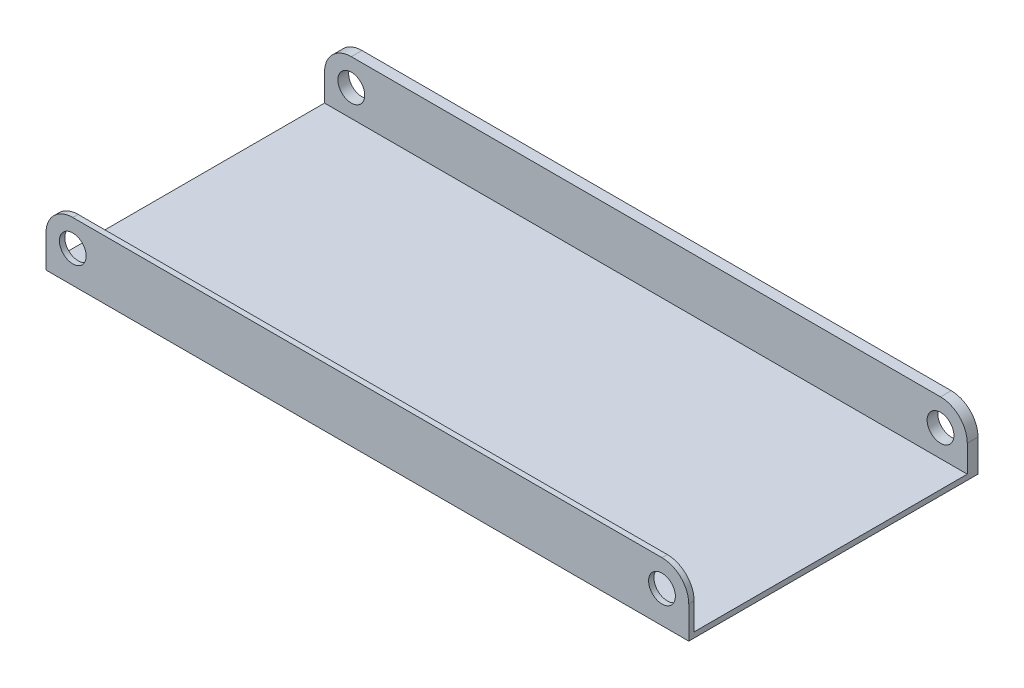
ISO-10303-21;
HEADER;
FILE_DESCRIPTION(('STEP AP214'),'2;1');
FILE_NAME('part.step','',(''),(''),'','','');
FILE_SCHEMA(('AUTOMOTIVE_DESIGN { 1 0 10303 214 1 1 1 1 }'));
ENDSEC;
DATA;
#1=APPLICATION_CONTEXT('core data for automotive mechanical design processes');
#2=APPLICATION_PROTOCOL_DEFINITION('international standard','automotive_design',2000,#1);
#3=PRODUCT_CONTEXT('',#1,'mechanical');
#4=PRODUCT('Part','Part','',(#3));
#5=PRODUCT_RELATED_PRODUCT_CATEGORY('part','',(#4));
#6=PRODUCT_DEFINITION_FORMATION('','',#4);
#7=PRODUCT_DEFINITION_CONTEXT('part definition',#1,'design');
#8=PRODUCT_DEFINITION('design','',#6,#7);
#9=PRODUCT_DEFINITION_SHAPE('','',#8);
#10=(LENGTH_UNIT() NAMED_UNIT(*) SI_UNIT(.MILLI.,.METRE.));
#11=(NAMED_UNIT(*) PLANE_ANGLE_UNIT() SI_UNIT($,.RADIAN.));
#12=(NAMED_UNIT(*) SI_UNIT($,.STERADIAN.) SOLID_ANGLE_UNIT());
#13=UNCERTAINTY_MEASURE_WITH_UNIT(LENGTH_MEASURE(1.E-05),#10,'distance_accuracy_value','');
#14=(GEOMETRIC_REPRESENTATION_CONTEXT(3) GLOBAL_UNCERTAINTY_ASSIGNED_CONTEXT((#13)) GLOBAL_UNIT_ASSIGNED_CONTEXT((#10,
#11,#12)) REPRESENTATION_CONTEXT('',''));
#15=CARTESIAN_POINT('',(0.,0.,0.));
#16=DIRECTION('',(0.,0.,1.));
#17=DIRECTION('',(1.,0.,0.));
#18=AXIS2_PLACEMENT_3D('',#15,#16,#17);
#19=CARTESIAN_POINT('',(0.,1.27,0.));
#20=DIRECTION('',(0.,1.,0.));
#21=DIRECTION('',(0.,0.,1.));
#22=AXIS2_PLACEMENT_3D('',#19,#20,#21);
#23=PLANE('',#22);
#24=DIRECTION('',(0.,0.,-1.));
#25=VECTOR('',#24,1.);
#26=CARTESIAN_POINT('',(152.4,1.27,0.));
#27=LINE('',#26,#25);
#28=CARTESIAN_POINT('',(152.4,1.27,67.31));
#29=VERTEX_POINT('',#28);
#30=CARTESIAN_POINT('',(152.4,1.27,2.53999999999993));
#31=VERTEX_POINT('',#30);
#32=EDGE_CURVE('E140',#29,#31,#27,.T.);
#33=ORIENTED_EDGE('',*,*,#32,.T.);
#34=DIRECTION('',(1.,0.,0.));
#35=VECTOR('',#34,1.);
#36=CARTESIAN_POINT('',(0.,1.27,2.53999999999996));
#37=LINE('',#36,#35);
#38=CARTESIAN_POINT('',(0.,1.27,2.53999999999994));
#39=VERTEX_POINT('',#38);
#40=EDGE_CURVE('E139',#39,#31,#37,.T.);
#41=ORIENTED_EDGE('',*,*,#40,.F.);
#42=DIRECTION('',(0.,0.,1.));
#43=VECTOR('',#42,1.);
#44=CARTESIAN_POINT('',(0.,1.27,0.));
#45=LINE('',#44,#43);
#46=CARTESIAN_POINT('',(0.,1.27,67.31));
#47=VERTEX_POINT('',#46);
#48=EDGE_CURVE('E123',#39,#47,#45,.T.);
#49=ORIENTED_EDGE('',*,*,#48,.T.);
#50=DIRECTION('',(-1.,0.,0.));
#51=VECTOR('',#50,1.);
#52=CARTESIAN_POINT('',(0.,1.27,67.31));
#53=LINE('',#52,#51);
#54=EDGE_CURVE('E136',#29,#47,#53,.T.);
#55=ORIENTED_EDGE('',*,*,#54,.F.);
#56=EDGE_LOOP('',(#33,#41,#49,#55));
#57=FACE_BOUND('',#56,.T.);
#58=ADVANCED_FACE('F34',(#57),#23,.T.);
#59=CARTESIAN_POINT('',(0.,1.27,0.));
#60=DIRECTION('',(1.,0.,0.));
#61=DIRECTION('',(0.,0.,-1.));
#62=AXIS2_PLACEMENT_3D('',#59,#60,#61);
#63=PLANE('',#62);
#64=DIRECTION('',(0.,-1.,0.));
#65=VECTOR('',#64,1.);
#66=CARTESIAN_POINT('',(0.,13.97,2.53999999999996));
#67=LINE('',#66,#65);
#68=CARTESIAN_POINT('',(0.,7.62,2.53999999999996));
#69=VERTEX_POINT('',#68);
#70=EDGE_CURVE('E147',#69,#39,#67,.T.);
#71=ORIENTED_EDGE('',*,*,#70,.F.);
#72=DIRECTION('',(0.,0.,1.));
#73=VECTOR('',#72,1.);
#74=CARTESIAN_POINT('',(0.,7.62,0.));
#75=LINE('',#74,#73);
#76=CARTESIAN_POINT('',(0.,7.62,0.));
#77=VERTEX_POINT('',#76);
#78=EDGE_CURVE('E11',#69,#77,#75,.F.);
#79=ORIENTED_EDGE('',*,*,#78,.T.);
#80=DIRECTION('',(0.,-1.,0.));
#81=VECTOR('',#80,1.);
#82=CARTESIAN_POINT('',(0.,1.27,0.));
#83=LINE('',#82,#81);
#84=CARTESIAN_POINT('',(0.,0.,0.));
#85=VERTEX_POINT('',#84);
#86=EDGE_CURVE('E158',#77,#85,#83,.T.);
#87=ORIENTED_EDGE('',*,*,#86,.T.);
#88=DIRECTION('',(0.,0.,1.));
#89=VECTOR('',#88,1.);
#90=CARTESIAN_POINT('',(0.,0.,0.));
#91=LINE('',#90,#89);
#92=CARTESIAN_POINT('',(0.,0.,68.58));
#93=VERTEX_POINT('',#92);
#94=EDGE_CURVE('E155',#85,#93,#91,.T.);
#95=ORIENTED_EDGE('',*,*,#94,.T.);
#96=DIRECTION('',(0.,-1.,0.));
#97=VECTOR('',#96,1.);
#98=CARTESIAN_POINT('',(0.,1.27,68.58));
#99=LINE('',#98,#97);
#100=CARTESIAN_POINT('',(0.,7.62,68.58));
#101=VERTEX_POINT('',#100);
#102=EDGE_CURVE('E174',#101,#93,#99,.T.);
#103=ORIENTED_EDGE('',*,*,#102,.F.);
#104=DIRECTION('',(0.,0.,1.));
#105=VECTOR('',#104,1.);
#106=CARTESIAN_POINT('',(0.,7.62,0.));
#107=LINE('',#106,#105);
#108=CARTESIAN_POINT('',(0.,7.62,67.31));
#109=VERTEX_POINT('',#108);
#110=EDGE_CURVE('E42',#101,#109,#107,.F.);
#111=ORIENTED_EDGE('',*,*,#110,.T.);
#112=DIRECTION('',(0.,-1.,0.));
#113=VECTOR('',#112,1.);
#114=CARTESIAN_POINT('',(0.,13.97,67.31));
#115=LINE('',#114,#113);
#116=EDGE_CURVE('E120',#109,#47,#115,.T.);
#117=ORIENTED_EDGE('',*,*,#116,.T.);
#118=ORIENTED_EDGE('',*,*,#48,.F.);
#119=EDGE_LOOP('',(#71,#79,#87,#95,#103,#111,#117,#118));
#120=FACE_BOUND('',#119,.T.);
#121=ADVANCED_FACE('F122',(#120),#63,.F.);
#122=CARTESIAN_POINT('',(0.,1.27,68.58));
#123=DIRECTION('',(0.,0.,-1.));
#124=DIRECTION('',(-1.,0.,0.));
#125=AXIS2_PLACEMENT_3D('',#122,#123,#124);
#126=PLANE('',#125);
#127=CARTESIAN_POINT('',(6.35,7.62,68.58));
#128=DIRECTION('',(0.,0.,1.));
#129=DIRECTION('',(1.,0.,0.));
#130=AXIS2_PLACEMENT_3D('',#127,#128,#129);
#131=CIRCLE('',#130,3.175);
#132=CARTESIAN_POINT('',(9.525,7.62,68.58));
#133=VERTEX_POINT('',#132);
#134=EDGE_CURVE('E307',#133,#133,#131,.T.);
#135=ORIENTED_EDGE('',*,*,#134,.F.);
#136=EDGE_LOOP('',(#135));
#137=FACE_BOUND('',#136,.T.);
#138=CARTESIAN_POINT('',(146.05,7.62,68.58));
#139=DIRECTION('',(0.,0.,1.));
#140=DIRECTION('',(1.,0.,0.));
#141=AXIS2_PLACEMENT_3D('',#138,#139,#140);
#142=CIRCLE('',#141,3.175);
#143=CARTESIAN_POINT('',(149.225,7.62,68.58));
#144=VERTEX_POINT('',#143);
#145=EDGE_CURVE('E301',#144,#144,#142,.T.);
#146=ORIENTED_EDGE('',*,*,#145,.F.);
#147=EDGE_LOOP('',(#146));
#148=FACE_BOUND('',#147,.T.);
#149=DIRECTION('',(0.,-1.,0.));
#150=VECTOR('',#149,1.);
#151=CARTESIAN_POINT('',(152.4,1.27,68.58));
#152=LINE('',#151,#150);
#153=CARTESIAN_POINT('',(152.4,7.62,68.58));
#154=VERTEX_POINT('',#153);
#155=CARTESIAN_POINT('',(152.4,0.,68.58));
#156=VERTEX_POINT('',#155);
#157=EDGE_CURVE('E172',#154,#156,#152,.T.);
#158=ORIENTED_EDGE('',*,*,#157,.F.);
#159=CARTESIAN_POINT('',(146.05,7.62,68.58));
#160=DIRECTION('',(0.,0.,-1.));
#161=DIRECTION('',(-1.,0.,0.));
#162=AXIS2_PLACEMENT_3D('',#159,#160,#161);
#163=CIRCLE('',#162,6.35);
#164=CARTESIAN_POINT('',(146.05,13.97,68.58));
#165=VERTEX_POINT('',#164);
#166=EDGE_CURVE('E201',#154,#165,#163,.F.);
#167=ORIENTED_EDGE('',*,*,#166,.T.);
#168=DIRECTION('',(1.,0.,0.));
#169=VECTOR('',#168,1.);
#170=CARTESIAN_POINT('',(0.,13.97,68.58));
#171=LINE('',#170,#169);
#172=CARTESIAN_POINT('',(6.35,13.97,68.58));
#173=VERTEX_POINT('',#172);
#174=EDGE_CURVE('E146',#173,#165,#171,.T.);
#175=ORIENTED_EDGE('',*,*,#174,.F.);
#176=CARTESIAN_POINT('',(6.35,7.62,68.58));
#177=DIRECTION('',(0.,0.,-1.));
#178=DIRECTION('',(-1.,0.,0.));
#179=AXIS2_PLACEMENT_3D('',#176,#177,#178);
#180=CIRCLE('',#179,6.35);
#181=EDGE_CURVE('E199',#173,#101,#180,.F.);
#182=ORIENTED_EDGE('',*,*,#181,.T.);
#183=ORIENTED_EDGE('',*,*,#102,.T.);
#184=DIRECTION('',(1.,0.,0.));
#185=VECTOR('',#184,1.);
#186=CARTESIAN_POINT('',(0.,0.,68.58));
#187=LINE('',#186,#185);
#188=EDGE_CURVE('E161',#93,#156,#187,.T.);
#189=ORIENTED_EDGE('',*,*,#188,.T.);
#190=EDGE_LOOP('',(#158,#167,#175,#182,#183,#189));
#191=FACE_BOUND('',#190,.T.);
#192=ADVANCED_FACE('F259',(#137,#148,#191),#126,.F.);
#193=CARTESIAN_POINT('',(152.4,1.27,0.));
#194=DIRECTION('',(-1.,0.,0.));
#195=DIRECTION('',(0.,0.,1.));
#196=AXIS2_PLACEMENT_3D('',#193,#194,#195);
#197=PLANE('',#196);
#198=DIRECTION('',(0.,-1.,0.));
#199=VECTOR('',#198,1.);
#200=CARTESIAN_POINT('',(152.4,13.97,67.31));
#201=LINE('',#200,#199);
#202=CARTESIAN_POINT('',(152.4,7.62,67.31));
#203=VERTEX_POINT('',#202);
#204=EDGE_CURVE('E129',#203,#29,#201,.T.);
#205=ORIENTED_EDGE('',*,*,#204,.F.);
#206=DIRECTION('',(0.,0.,-1.));
#207=VECTOR('',#206,1.);
#208=CARTESIAN_POINT('',(152.4,7.62,0.));
#209=LINE('',#208,#207);
#210=EDGE_CURVE('E197',#203,#154,#209,.F.);
#211=ORIENTED_EDGE('',*,*,#210,.T.);
#212=ORIENTED_EDGE('',*,*,#157,.T.);
#213=DIRECTION('',(0.,0.,-1.));
#214=VECTOR('',#213,1.);
#215=CARTESIAN_POINT('',(152.4,0.,0.));
#216=LINE('',#215,#214);
#217=CARTESIAN_POINT('',(152.4,0.,0.));
#218=VERTEX_POINT('',#217);
#219=EDGE_CURVE('E164',#156,#218,#216,.T.);
#220=ORIENTED_EDGE('',*,*,#219,.T.);
#221=DIRECTION('',(0.,-1.,0.));
#222=VECTOR('',#221,1.);
#223=CARTESIAN_POINT('',(152.4,1.27,0.));
#224=LINE('',#223,#222);
#225=CARTESIAN_POINT('',(152.4,7.62,0.));
#226=VERTEX_POINT('',#225);
#227=EDGE_CURVE('E170',#226,#218,#224,.T.);
#228=ORIENTED_EDGE('',*,*,#227,.F.);
#229=DIRECTION('',(0.,0.,-1.));
#230=VECTOR('',#229,1.);
#231=CARTESIAN_POINT('',(152.4,7.62,2.53999999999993));
#232=LINE('',#231,#230);
#233=CARTESIAN_POINT('',(152.4,7.62,2.53999999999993));
#234=VERTEX_POINT('',#233);
#235=EDGE_CURVE('E195',#226,#234,#232,.F.);
#236=ORIENTED_EDGE('',*,*,#235,.T.);
#237=DIRECTION('',(0.,-1.,0.));
#238=VECTOR('',#237,1.);
#239=CARTESIAN_POINT('',(152.4,13.97,2.53999999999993));
#240=LINE('',#239,#238);
#241=EDGE_CURVE('E151',#234,#31,#240,.T.);
#242=ORIENTED_EDGE('',*,*,#241,.T.);
#243=ORIENTED_EDGE('',*,*,#32,.F.);
#244=EDGE_LOOP('',(#205,#211,#212,#220,#228,#236,#242,#243));
#245=FACE_BOUND('',#244,.T.);
#246=ADVANCED_FACE('F235',(#245),#197,.F.);
#247=CARTESIAN_POINT('',(0.,1.27,0.));
#248=DIRECTION('',(0.,0.,1.));
#249=DIRECTION('',(1.,0.,0.));
#250=AXIS2_PLACEMENT_3D('',#247,#248,#249);
#251=PLANE('',#250);
#252=CARTESIAN_POINT('',(6.35,7.62,0.));
#253=DIRECTION('',(0.,0.,1.));
#254=DIRECTION('',(1.,0.,0.));
#255=AXIS2_PLACEMENT_3D('',#252,#253,#254);
#256=CIRCLE('',#255,3.175);
#257=CARTESIAN_POINT('',(9.525,7.62,0.));
#258=VERTEX_POINT('',#257);
#259=EDGE_CURVE('E181',#258,#258,#256,.T.);
#260=ORIENTED_EDGE('',*,*,#259,.T.);
#261=EDGE_LOOP('',(#260));
#262=FACE_BOUND('',#261,.T.);
#263=CARTESIAN_POINT('',(146.05,7.62,0.));
#264=DIRECTION('',(0.,0.,1.));
#265=DIRECTION('',(1.,0.,0.));
#266=AXIS2_PLACEMENT_3D('',#263,#264,#265);
#267=CIRCLE('',#266,3.175);
#268=CARTESIAN_POINT('',(149.225,7.62,0.));
#269=VERTEX_POINT('',#268);
#270=EDGE_CURVE('E304',#269,#269,#267,.T.);
#271=ORIENTED_EDGE('',*,*,#270,.T.);
#272=EDGE_LOOP('',(#271));
#273=FACE_BOUND('',#272,.T.);
#274=DIRECTION('',(-1.,0.,0.));
#275=VECTOR('',#274,1.);
#276=CARTESIAN_POINT('',(0.,13.97,0.));
#277=LINE('',#276,#275);
#278=CARTESIAN_POINT('',(146.05,13.97,0.));
#279=VERTEX_POINT('',#278);
#280=CARTESIAN_POINT('',(6.35,13.97,0.));
#281=VERTEX_POINT('',#280);
#282=EDGE_CURVE('E228',#279,#281,#277,.T.);
#283=ORIENTED_EDGE('',*,*,#282,.F.);
#284=CARTESIAN_POINT('',(146.05,7.62,0.));
#285=DIRECTION('',(0.,0.,1.));
#286=DIRECTION('',(1.,0.,0.));
#287=AXIS2_PLACEMENT_3D('',#284,#285,#286);
#288=CIRCLE('',#287,6.35);
#289=EDGE_CURVE('E211',#279,#226,#288,.F.);
#290=ORIENTED_EDGE('',*,*,#289,.T.);
#291=ORIENTED_EDGE('',*,*,#227,.T.);
#292=DIRECTION('',(-1.,0.,0.));
#293=VECTOR('',#292,1.);
#294=CARTESIAN_POINT('',(0.,0.,0.));
#295=LINE('',#294,#293);
#296=EDGE_CURVE('E141',#218,#85,#295,.T.);
#297=ORIENTED_EDGE('',*,*,#296,.T.);
#298=ORIENTED_EDGE('',*,*,#86,.F.);
#299=CARTESIAN_POINT('',(6.35,7.62,0.));
#300=DIRECTION('',(0.,0.,1.));
#301=DIRECTION('',(1.,0.,0.));
#302=AXIS2_PLACEMENT_3D('',#299,#300,#301);
#303=CIRCLE('',#302,6.35);
#304=EDGE_CURVE('E209',#77,#281,#303,.F.);
#305=ORIENTED_EDGE('',*,*,#304,.T.);
#306=EDGE_LOOP('',(#283,#290,#291,#297,#298,#305));
#307=FACE_BOUND('',#306,.T.);
#308=ADVANCED_FACE('F233',(#262,#273,#307),#251,.F.);
#309=CARTESIAN_POINT('',(0.,0.,0.));
#310=DIRECTION('',(0.,1.,0.));
#311=DIRECTION('',(0.,0.,1.));
#312=AXIS2_PLACEMENT_3D('',#309,#310,#311);
#313=PLANE('',#312);
#314=ORIENTED_EDGE('',*,*,#94,.F.);
#315=ORIENTED_EDGE('',*,*,#296,.F.);
#316=ORIENTED_EDGE('',*,*,#219,.F.);
#317=ORIENTED_EDGE('',*,*,#188,.F.);
#318=EDGE_LOOP('',(#314,#315,#316,#317));
#319=FACE_BOUND('',#318,.T.);
#320=ADVANCED_FACE('F242',(#319),#313,.F.);
#321=CARTESIAN_POINT('',(0.,13.97,67.31));
#322=DIRECTION('',(0.,0.,1.));
#323=DIRECTION('',(1.,0.,0.));
#324=AXIS2_PLACEMENT_3D('',#321,#322,#323);
#325=PLANE('',#324);
#326=CARTESIAN_POINT('',(6.35,7.62,67.31));
#327=DIRECTION('',(0.,0.,1.));
#328=DIRECTION('',(1.,0.,0.));
#329=AXIS2_PLACEMENT_3D('',#326,#327,#328);
#330=CIRCLE('',#329,3.175);
#331=CARTESIAN_POINT('',(9.525,7.62,67.31));
#332=VERTEX_POINT('',#331);
#333=EDGE_CURVE('E185',#332,#332,#330,.T.);
#334=ORIENTED_EDGE('',*,*,#333,.T.);
#335=EDGE_LOOP('',(#334));
#336=FACE_BOUND('',#335,.T.);
#337=CARTESIAN_POINT('',(146.05,7.62,67.31));
#338=DIRECTION('',(0.,0.,1.));
#339=DIRECTION('',(1.,0.,0.));
#340=AXIS2_PLACEMENT_3D('',#337,#338,#339);
#341=CIRCLE('',#340,3.175);
#342=CARTESIAN_POINT('',(149.225,7.62,67.31));
#343=VERTEX_POINT('',#342);
#344=EDGE_CURVE('E180',#343,#343,#341,.T.);
#345=ORIENTED_EDGE('',*,*,#344,.T.);
#346=EDGE_LOOP('',(#345));
#347=FACE_BOUND('',#346,.T.);
#348=DIRECTION('',(-1.,0.,0.));
#349=VECTOR('',#348,1.);
#350=CARTESIAN_POINT('',(0.,13.97,67.31));
#351=LINE('',#350,#349);
#352=CARTESIAN_POINT('',(146.05,13.97,67.31));
#353=VERTEX_POINT('',#352);
#354=CARTESIAN_POINT('',(6.35,13.97,67.31));
#355=VERTEX_POINT('',#354);
#356=EDGE_CURVE('E130',#353,#355,#351,.T.);
#357=ORIENTED_EDGE('',*,*,#356,.F.);
#358=CARTESIAN_POINT('',(146.05,7.62,67.31));
#359=DIRECTION('',(0.,0.,1.));
#360=DIRECTION('',(1.,0.,0.));
#361=AXIS2_PLACEMENT_3D('',#358,#359,#360);
#362=CIRCLE('',#361,6.35);
#363=EDGE_CURVE('E193',#353,#203,#362,.F.);
#364=ORIENTED_EDGE('',*,*,#363,.T.);
#365=ORIENTED_EDGE('',*,*,#204,.T.);
#366=ORIENTED_EDGE('',*,*,#54,.T.);
#367=ORIENTED_EDGE('',*,*,#116,.F.);
#368=CARTESIAN_POINT('',(6.35,7.62,67.31));
#369=DIRECTION('',(0.,0.,1.));
#370=DIRECTION('',(1.,0.,0.));
#371=AXIS2_PLACEMENT_3D('',#368,#369,#370);
#372=CIRCLE('',#371,6.35);
#373=EDGE_CURVE('E191',#109,#355,#372,.F.);
#374=ORIENTED_EDGE('',*,*,#373,.T.);
#375=EDGE_LOOP('',(#357,#364,#365,#366,#367,#374));
#376=FACE_BOUND('',#375,.T.);
#377=ADVANCED_FACE('F144',(#336,#347,#376),#325,.F.);
#378=CARTESIAN_POINT('',(0.,13.97,0.));
#379=DIRECTION('',(0.,-1.,0.));
#380=DIRECTION('',(0.,0.,-1.));
#381=AXIS2_PLACEMENT_3D('',#378,#379,#380);
#382=PLANE('',#381);
#383=ORIENTED_EDGE('',*,*,#174,.T.);
#384=DIRECTION('',(0.,0.,-1.));
#385=VECTOR('',#384,1.);
#386=CARTESIAN_POINT('',(146.05,13.97,0.));
#387=LINE('',#386,#385);
#388=EDGE_CURVE('E188',#165,#353,#387,.T.);
#389=ORIENTED_EDGE('',*,*,#388,.T.);
#390=ORIENTED_EDGE('',*,*,#356,.T.);
#391=DIRECTION('',(0.,0.,1.));
#392=VECTOR('',#391,1.);
#393=CARTESIAN_POINT('',(6.35,13.97,0.));
#394=LINE('',#393,#392);
#395=EDGE_CURVE('E176',#355,#173,#394,.T.);
#396=ORIENTED_EDGE('',*,*,#395,.T.);
#397=EDGE_LOOP('',(#383,#389,#390,#396));
#398=FACE_BOUND('',#397,.T.);
#399=ADVANCED_FACE('F290',(#398),#382,.F.);
#400=CARTESIAN_POINT('',(0.,13.97,2.53999999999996));
#401=DIRECTION('',(0.,0.,-1.));
#402=DIRECTION('',(-1.,0.,0.));
#403=AXIS2_PLACEMENT_3D('',#400,#401,#402);
#404=PLANE('',#403);
#405=CARTESIAN_POINT('',(6.35,7.62,2.53999999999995));
#406=DIRECTION('',(0.,0.,-1.));
#407=DIRECTION('',(-1.,0.,0.));
#408=AXIS2_PLACEMENT_3D('',#405,#406,#407);
#409=CIRCLE('',#408,3.175);
#410=CARTESIAN_POINT('',(3.175,7.62,2.53999999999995));
#411=VERTEX_POINT('',#410);
#412=EDGE_CURVE('E182',#411,#411,#409,.T.);
#413=ORIENTED_EDGE('',*,*,#412,.T.);
#414=EDGE_LOOP('',(#413));
#415=FACE_BOUND('',#414,.T.);
#416=CARTESIAN_POINT('',(146.05,7.62,2.53999999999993));
#417=DIRECTION('',(0.,0.,-1.));
#418=DIRECTION('',(-1.,0.,0.));
#419=AXIS2_PLACEMENT_3D('',#416,#417,#418);
#420=CIRCLE('',#419,3.175);
#421=CARTESIAN_POINT('',(142.875,7.62,2.53999999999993));
#422=VERTEX_POINT('',#421);
#423=EDGE_CURVE('E177',#422,#422,#420,.T.);
#424=ORIENTED_EDGE('',*,*,#423,.T.);
#425=EDGE_LOOP('',(#424));
#426=FACE_BOUND('',#425,.T.);
#427=ORIENTED_EDGE('',*,*,#241,.F.);
#428=CARTESIAN_POINT('',(146.05,7.62,2.53999999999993));
#429=DIRECTION('',(0.,0.,-1.));
#430=DIRECTION('',(-1.,0.,0.));
#431=AXIS2_PLACEMENT_3D('',#428,#429,#430);
#432=CIRCLE('',#431,6.35);
#433=CARTESIAN_POINT('',(146.05,13.97,2.53999999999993));
#434=VERTEX_POINT('',#433);
#435=EDGE_CURVE('E214',#234,#434,#432,.F.);
#436=ORIENTED_EDGE('',*,*,#435,.T.);
#437=DIRECTION('',(1.,0.,0.));
#438=VECTOR('',#437,1.);
#439=CARTESIAN_POINT('',(0.,13.97,2.53999999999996));
#440=LINE('',#439,#438);
#441=CARTESIAN_POINT('',(6.35,13.97,2.53999999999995));
#442=VERTEX_POINT('',#441);
#443=EDGE_CURVE('E219',#442,#434,#440,.T.);
#444=ORIENTED_EDGE('',*,*,#443,.F.);
#445=CARTESIAN_POINT('',(6.35,7.62,2.53999999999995));
#446=DIRECTION('',(0.,0.,-1.));
#447=DIRECTION('',(-1.,0.,0.));
#448=AXIS2_PLACEMENT_3D('',#445,#446,#447);
#449=CIRCLE('',#448,6.35);
#450=EDGE_CURVE('E49',#442,#69,#449,.F.);
#451=ORIENTED_EDGE('',*,*,#450,.T.);
#452=ORIENTED_EDGE('',*,*,#70,.T.);
#453=ORIENTED_EDGE('',*,*,#40,.T.);
#454=EDGE_LOOP('',(#427,#436,#444,#451,#452,#453));
#455=FACE_BOUND('',#454,.T.);
#456=ADVANCED_FACE('F218',(#415,#426,#455),#404,.F.);
#457=CARTESIAN_POINT('',(0.,13.97,0.));
#458=DIRECTION('',(0.,1.,0.));
#459=DIRECTION('',(0.,0.,1.));
#460=AXIS2_PLACEMENT_3D('',#457,#458,#459);
#461=PLANE('',#460);
#462=ORIENTED_EDGE('',*,*,#443,.T.);
#463=DIRECTION('',(0.,0.,-1.));
#464=VECTOR('',#463,1.);
#465=CARTESIAN_POINT('',(146.05,13.97,0.));
#466=LINE('',#465,#464);
#467=EDGE_CURVE('E206',#434,#279,#466,.T.);
#468=ORIENTED_EDGE('',*,*,#467,.T.);
#469=ORIENTED_EDGE('',*,*,#282,.T.);
#470=DIRECTION('',(0.,0.,1.));
#471=VECTOR('',#470,1.);
#472=CARTESIAN_POINT('',(6.35,13.97,2.53999999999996));
#473=LINE('',#472,#471);
#474=EDGE_CURVE('E203',#281,#442,#473,.T.);
#475=ORIENTED_EDGE('',*,*,#474,.T.);
#476=EDGE_LOOP('',(#462,#468,#469,#475));
#477=FACE_BOUND('',#476,.T.);
#478=ADVANCED_FACE('F224',(#477),#461,.T.);
#479=CARTESIAN_POINT('',(146.05,7.62,0.));
#480=DIRECTION('',(0.,0.,1.));
#481=DIRECTION('',(1.,0.,0.));
#482=AXIS2_PLACEMENT_3D('',#479,#480,#481);
#483=CYLINDRICAL_SURFACE('',#482,3.175);
#484=ORIENTED_EDGE('',*,*,#270,.F.);
#485=EDGE_LOOP('',(#484));
#486=FACE_BOUND('',#485,.T.);
#487=ORIENTED_EDGE('',*,*,#423,.F.);
#488=EDGE_LOOP('',(#487));
#489=FACE_BOUND('',#488,.T.);
#490=ADVANCED_FACE('F316',(#486,#489),#483,.F.);
#491=CARTESIAN_POINT('',(6.35,7.62,0.));
#492=DIRECTION('',(0.,0.,1.));
#493=DIRECTION('',(1.,0.,0.));
#494=AXIS2_PLACEMENT_3D('',#491,#492,#493);
#495=CYLINDRICAL_SURFACE('',#494,3.175);
#496=ORIENTED_EDGE('',*,*,#259,.F.);
#497=EDGE_LOOP('',(#496));
#498=FACE_BOUND('',#497,.T.);
#499=ORIENTED_EDGE('',*,*,#412,.F.);
#500=EDGE_LOOP('',(#499));
#501=FACE_BOUND('',#500,.T.);
#502=ADVANCED_FACE('F283',(#498,#501),#495,.F.);
#503=ORIENTED_EDGE('',*,*,#145,.T.);
#504=EDGE_LOOP('',(#503));
#505=FACE_BOUND('',#504,.T.);
#506=ORIENTED_EDGE('',*,*,#344,.F.);
#507=EDGE_LOOP('',(#506));
#508=FACE_BOUND('',#507,.T.);
#509=ADVANCED_FACE('F280',(#505,#508),#483,.F.);
#510=ORIENTED_EDGE('',*,*,#134,.T.);
#511=EDGE_LOOP('',(#510));
#512=FACE_BOUND('',#511,.T.);
#513=ORIENTED_EDGE('',*,*,#333,.F.);
#514=EDGE_LOOP('',(#513));
#515=FACE_BOUND('',#514,.T.);
#516=ADVANCED_FACE('F275',(#512,#515),#495,.F.);
#517=CARTESIAN_POINT('',(146.05,7.62,0.));
#518=DIRECTION('',(0.,0.,-1.));
#519=DIRECTION('',(-1.,0.,0.));
#520=AXIS2_PLACEMENT_3D('',#517,#518,#519);
#521=CYLINDRICAL_SURFACE('',#520,6.35);
#522=ORIENTED_EDGE('',*,*,#166,.F.);
#523=ORIENTED_EDGE('',*,*,#210,.F.);
#524=ORIENTED_EDGE('',*,*,#363,.F.);
#525=ORIENTED_EDGE('',*,*,#388,.F.);
#526=EDGE_LOOP('',(#522,#523,#524,#525));
#527=FACE_BOUND('',#526,.T.);
#528=ADVANCED_FACE('F252',(#527),#521,.T.);
#529=CARTESIAN_POINT('',(146.05,7.62,0.));
#530=DIRECTION('',(0.,0.,1.));
#531=DIRECTION('',(1.,0.,0.));
#532=AXIS2_PLACEMENT_3D('',#529,#530,#531);
#533=CYLINDRICAL_SURFACE('',#532,6.35);
#534=ORIENTED_EDGE('',*,*,#435,.F.);
#535=ORIENTED_EDGE('',*,*,#235,.F.);
#536=ORIENTED_EDGE('',*,*,#289,.F.);
#537=ORIENTED_EDGE('',*,*,#467,.F.);
#538=EDGE_LOOP('',(#534,#535,#536,#537));
#539=FACE_BOUND('',#538,.T.);
#540=ADVANCED_FACE('F230',(#539),#533,.T.);
#541=CARTESIAN_POINT('',(6.35,7.62,0.));
#542=DIRECTION('',(0.,0.,-1.));
#543=DIRECTION('',(-1.,0.,0.));
#544=AXIS2_PLACEMENT_3D('',#541,#542,#543);
#545=CYLINDRICAL_SURFACE('',#544,6.35);
#546=ORIENTED_EDGE('',*,*,#304,.F.);
#547=ORIENTED_EDGE('',*,*,#78,.F.);
#548=ORIENTED_EDGE('',*,*,#450,.F.);
#549=ORIENTED_EDGE('',*,*,#474,.F.);
#550=EDGE_LOOP('',(#546,#547,#548,#549));
#551=FACE_BOUND('',#550,.T.);
#552=ADVANCED_FACE('F245',(#551),#545,.T.);
#553=CARTESIAN_POINT('',(6.35,7.62,0.));
#554=DIRECTION('',(0.,0.,1.));
#555=DIRECTION('',(1.,0.,0.));
#556=AXIS2_PLACEMENT_3D('',#553,#554,#555);
#557=CYLINDRICAL_SURFACE('',#556,6.35);
#558=ORIENTED_EDGE('',*,*,#373,.F.);
#559=ORIENTED_EDGE('',*,*,#110,.F.);
#560=ORIENTED_EDGE('',*,*,#181,.F.);
#561=ORIENTED_EDGE('',*,*,#395,.F.);
#562=EDGE_LOOP('',(#558,#559,#560,#561));
#563=FACE_BOUND('',#562,.T.);
#564=ADVANCED_FACE('F36',(#563),#557,.T.);
#565=CLOSED_SHELL('',(#58,#121,#192,#246,#308,#320,#377,#399,#456,#478,#490,#502,#509,#516,#528,
#540,#552,#564));
#566=MANIFOLD_SOLID_BREP('B2',#565);
#567=ADVANCED_BREP_SHAPE_REPRESENTATION('',(#18,#566),#14);
#568=SHAPE_DEFINITION_REPRESENTATION(#9,#567);
ENDSEC;
END-ISO-10303-21;
